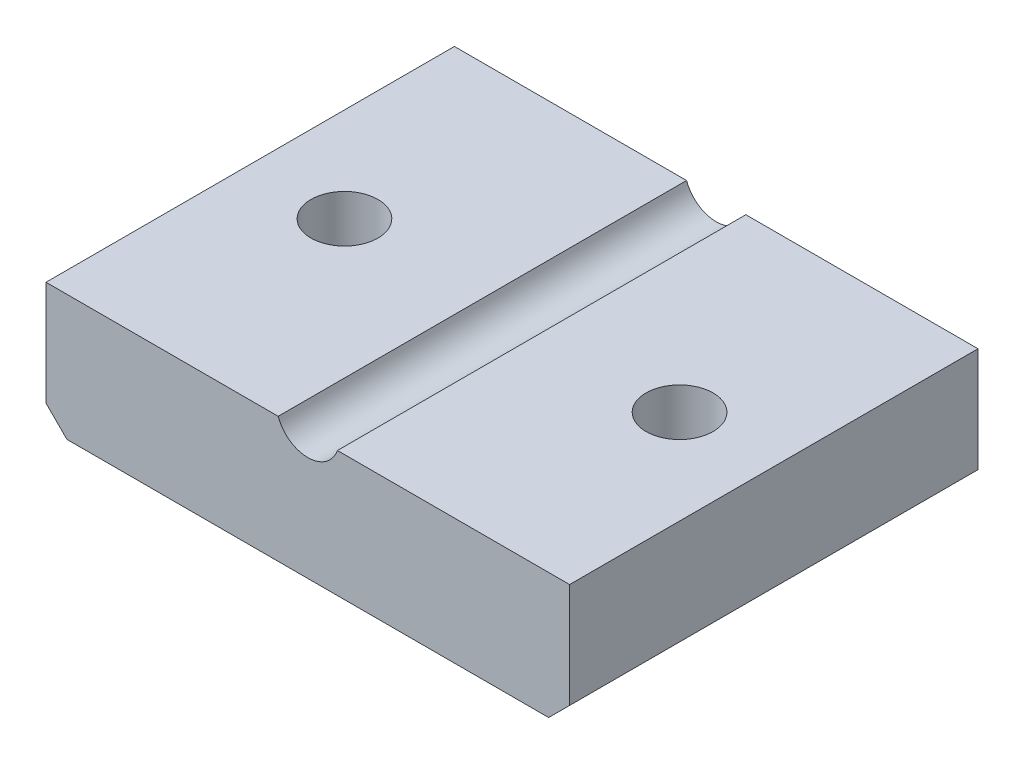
from build123d import *

# Parameters (mm, degrees)
LINEAR_AUSTRAGEN1_DEPTH          = 9.75
LINEAR_AUSTRAGEN1_DEPTH_BACK     = 9.75
FASE1_SIZE                       = 1
F_3_2_3_2_DURCHMESSER_BOHRUNG1_D = 3.2


with BuildPart() as part:
    # Skizze1 → Linear austragen1 (new, two sides: drawn at the far end of the back side and taken through both)
    with BuildSketch(Plane.XY.offset(-LINEAR_AUSTRAGEN1_DEPTH_BACK)):
        with BuildLine():
            Line((1.414213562, -0.5), (12.5, -0.5))
            Line((12.5, -0.5), (12.5, -6.5))
            Line((12.5, -6.5), (-12.5, -6.5))
            Line((-12.5, -6.5), (-12.5, -0.5))
            Line((-12.5, -0.5), (-1.414213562, -0.5))
            ThreePointArc((-1.414213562, -0.5), (0, -1.5), (1.414213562, -0.5))
        make_face()
    extrude(amount=LINEAR_AUSTRAGEN1_DEPTH + LINEAR_AUSTRAGEN1_DEPTH_BACK)

    # Fase1
    fase1_edges = [part.edges().sort_by_distance(p)[0] for p in [
        (12.5, -6.5, 0),
        (-12.5, -6.5, 0),
    ]]
    chamfer(fase1_edges, length=FASE1_SIZE)

    # 3.2 _3.2_ Durchmesser Bohrung1 (through all)
    with Locations(Plane.XZ.offset(6.5)):
        with Locations((-8, 0), (8, 0)):
            Hole(F_3_2_3_2_DURCHMESSER_BOHRUNG1_D / 2)


solid = part.part
